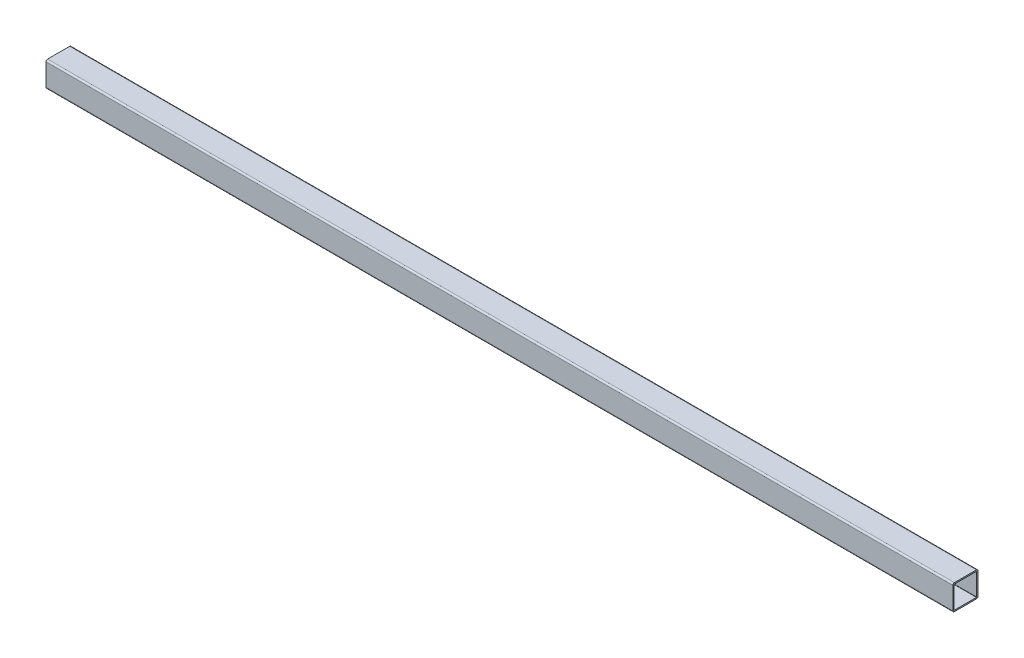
from build123d import *

# Parameters (mm, degrees)
EXTRUDE1_DEPTH = 914.4


with BuildPart() as part:
    # Sketch1 → Extrude1 (new body)
    with BuildSketch(Plane(origin=(0, 0, 0), x_dir=(0, 0, -1), z_dir=(1, 0, 0))):
        with BuildLine():
            Line((-5.373037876, 5.244240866), (16.851962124, 5.244240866))
            ThreePointArc((16.851962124, 5.244240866), (17.974494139, 4.779272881), (18.439462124, 3.656740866))
            Line((18.439462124, 3.656740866), (18.439462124, -18.568259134))
            ThreePointArc((18.439462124, -18.568259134), (17.974494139, -19.690791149), (16.851962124, -20.155759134))
            Line((16.851962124, -20.155759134), (-5.373037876, -20.155759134))
            ThreePointArc((-5.373037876, -20.155759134), (-6.495569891, -19.690791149), (-6.960537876, -18.568259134))
            Line((-6.960537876, -18.568259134), (-6.960537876, 3.656740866))
            ThreePointArc((-6.960537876, 3.656740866), (-6.495569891, 4.779272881), (-5.373037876, 5.244240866))
        make_face()
        with BuildLine():
            Line((-5.373037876, 3.898040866), (16.851962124, 3.898040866))
            ThreePointArc((16.851962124, 3.898040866), (17.02258699, 3.827365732), (17.093262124, 3.656740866))
            Line((17.093262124, 3.656740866), (17.093262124, -18.568259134))
            ThreePointArc((17.093262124, -18.568259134), (17.02258699, -18.738884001), (16.851962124, -18.809559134))
            Line((16.851962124, -18.809559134), (-5.373037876, -18.809559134))
            ThreePointArc((-5.373037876, -18.809559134), (-5.543662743, -18.738884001), (-5.614337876, -18.568259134))
            Line((-5.614337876, -18.568259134), (-5.614337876, 3.656740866))
            ThreePointArc((-5.614337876, 3.656740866), (-5.543662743, 3.827365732), (-5.373037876, 3.898040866))
        make_face(mode=Mode.SUBTRACT)
    extrude(amount=EXTRUDE1_DEPTH)


solid = part.part
